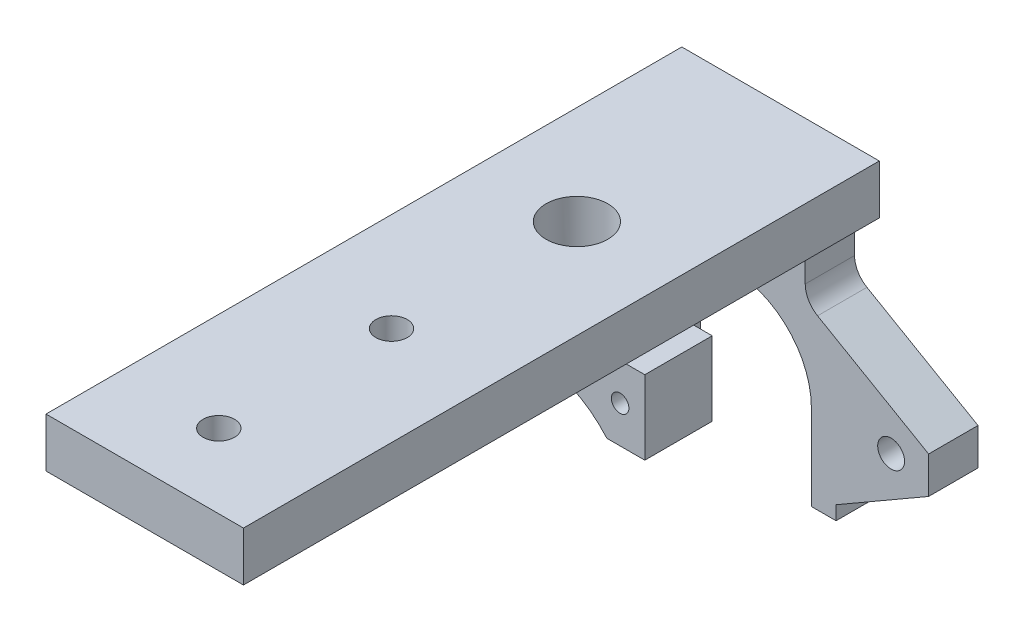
from build123d import *

# Parameters (mm, degrees)
EXTRUDE1_DEPTH            = 25.4
CUT_EXTRUDE1_REACH        = 95.1
SKETCH6_W                 = 12.7
SKETCH6_H                 = 75.438
CUT_EXTRUDE2_DEPTH        = 91.797650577
EXTRUDE2_DEPTH            = 2.38125
EXTRUDE2_DEPTH_BACK       = 27.78125
SKETCH7_W                 = 8.6741
SKETCH7_H                 = 9.525
CUT_EXTRUDE4_REACH        = 68.358
SKETCH11_R                = 13.49375
F_4_40_TAPPED_HOLE1_D     = 2.2606
F_4_40_TAPPED_HOLE1_DEPTH = 8.6741
F_8_32_TAPPED_HOLE4_D     = 3.4544
F_8_32_TAPPED_HOLE4_DEPTH = 6.77545
CUT_EXTRUDE3_REACH        = 90.093
SKETCH8_R                 = 3.96875
F_10_32_TAPPED_HOLE1_D    = 4.0386
CUT_EXTRUDE5_REACH        = 95.1


with BuildPart() as part:
    # Sketch1 → Extrude1 (new, symmetric)
    with BuildSketch(Plane(origin=(0, 0, 0), x_dir=(0, 0, -1), z_dir=(1, 0, 0))):
        Polygon((0, 0), (-81.788, 0), (-81.788, -6.35), (-6.35, -6.35), (-6.35, -36.5125), (0, -36.5125), align=None)
    extrude(amount=EXTRUDE1_DEPTH, both=True)

    # Sketch2 → Cut-Extrude1 (cut, up to next)
    with BuildSketch(Plane(origin=(0, 0, 0), x_dir=(-1, 0, 0), z_dir=(0, 0, -1)), mode=Mode.PRIVATE) as cut_extrude1_sk1:
        with BuildLine():
            Line((-10.31875, -25.5016), (-10.31875, -41.376576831))
            Line((-10.31875, -41.376576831), (10.31875, -41.376576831))
            Line((10.31875, -41.376576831), (10.31875, -25.5016))
            ThreePointArc((10.31875, -25.5016), (0, -15.18285), (-10.31875, -25.5016))
        make_face()
    cut_extrude1_tool1 = extrude(cut_extrude1_sk1.sketch, amount=-CUT_EXTRUDE1_REACH, mode=Mode.PRIVATE) & part.part
    add(cut_extrude1_tool1.solids().sort_by_distance((0, -29.276324, 0))[0], mode=Mode.SUBTRACT)

    # Sketch6 → Cut-Extrude2 (cut, through all)
    with BuildSketch(Plane.XZ.offset(6.35)):
        with Locations((19.05, 44.069)):
            Rectangle(SKETCH6_W, SKETCH6_H)
        with Locations((-19.05, 44.069)):
            Rectangle(SKETCH6_W, SKETCH6_H)
    extrude(amount=-CUT_EXTRUDE2_DEPTH, mode=Mode.SUBTRACT)

    # Sketch7 → Extrude2 (add, two sides: drawn at the far end of the back side and taken through both)
    with BuildSketch(Plane(origin=(12.7, 0, 0), x_dir=(0, 0, -1), z_dir=(1, 0, 0)).offset(-EXTRUDE2_DEPTH_BACK)):
        with Locations((-28.2067, -11.1125)):
            Rectangle(SKETCH7_W, SKETCH7_H)
    extrude(amount=EXTRUDE2_DEPTH + EXTRUDE2_DEPTH_BACK)

    # Sketch11 → Cut-Extrude4 (cut, up to next)
    with BuildSketch(Plane.XY.offset(32.54375), mode=Mode.PRIVATE) as cut_extrude4_sk1:
        with Locations((0, -24.70785)):
            Circle(SKETCH11_R)
    cut_extrude4_tool1 = extrude(cut_extrude4_sk1.sketch, amount=-CUT_EXTRUDE4_REACH, mode=Mode.PRIVATE) & part.part
    add(cut_extrude4_tool1.solids().sort_by_distance((0, -24.70785, 32.54375))[0], mode=Mode.SUBTRACT)

    # 4-40 Tapped Hole1
    with Locations(Plane.XY.offset(32.54375)):
        with Locations((-11.90625, -11.1125), (11.90625, -11.1125)):
            Hole(F_4_40_TAPPED_HOLE1_D / 2, depth=F_4_40_TAPPED_HOLE1_DEPTH)

    # 8-32 Tapped Hole4
    with Locations(Plane(origin=(20.57399608, -25.4889, 0), x_dir=(0, -1, 0), z_dir=(0, 0, -1))):
        with Locations((0, 0), (0, 41.148)):
            Hole(F_8_32_TAPPED_HOLE4_D / 2, depth=F_8_32_TAPPED_HOLE4_DEPTH)

    # Sketch8 → Cut-Extrude3 (cut, up to next)
    with BuildSketch(Plane.XZ.offset(15.875), mode=Mode.PRIVATE) as cut_extrude3_sk1:
        with Locations(Location((0, 26.19375, 0), (0, 0, 324.154611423))):
            Circle(SKETCH8_R)
    cut_extrude3_tool1 = extrude(cut_extrude3_sk1.sketch, amount=-CUT_EXTRUDE3_REACH, mode=Mode.PRIVATE) & part.part
    add(cut_extrude3_tool1.solids().sort_by_distance((0, -15.875, 26.19375))[0], mode=Mode.SUBTRACT)

    # 10-32 Tapped Hole1 (through all)
    with Locations(Plane(origin=(0, 0, 0), x_dir=(-1, 0, 0), z_dir=(0, 1, 0))):
        with Locations((0, 72.263), (0, 50.038)):
            Hole(F_10_32_TAPPED_HOLE1_D / 2)

    # Sketch12 → Cut-Extrude5 (cut, up to next)
    with BuildSketch(Plane.XY, mode=Mode.PRIVATE) as cut_extrude5_sk1:
        with BuildLine():
            Line((12.7, 0), (12.7, -6.35))
            ThreePointArc((12.7, -6.35), (10.45493597, -7.27993597), (9.525, -9.525))
            Line((9.525, -9.525), (9.525, -12.118934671))
            ThreePointArc((9.525, -12.118934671), (9.950369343, -13.706434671), (11.1125, -14.868565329))
            Line((11.1125, -14.868565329), (25.4, -23.1174573))
            Line((25.4, -23.1174573), (25.4, 0))
            Line((25.4, 0), (12.7, 0))
        make_face()
    cut_extrude5_tool1 = extrude(cut_extrude5_sk1.sketch, amount=CUT_EXTRUDE5_REACH, mode=Mode.PRIVATE) & part.part
    # Sketch12 → Cut-Extrude5 (cut, up to next)
    with BuildSketch(Plane.XY, mode=Mode.PRIVATE) as cut_extrude5_sk2:
        Polygon((25.4, -27.8511), (13.49375, -34.725176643), (13.49375, -36.5125), (25.4, -36.5125), align=None)
    cut_extrude5_tool2 = extrude(cut_extrude5_sk2.sketch, amount=CUT_EXTRUDE5_REACH, mode=Mode.PRIVATE) & part.part
    # Sketch12 → Cut-Extrude5 (cut, up to next)
    with BuildSketch(Plane.XY, mode=Mode.PRIVATE) as cut_extrude5_sk3:
        Polygon((-13.49375, -34.725176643), (-13.49375, -36.5125), (-25.4, -36.5125), (-25.4, -27.8511), align=None)
    cut_extrude5_tool3 = extrude(cut_extrude5_sk3.sketch, amount=CUT_EXTRUDE5_REACH, mode=Mode.PRIVATE) & part.part
    # Sketch12 → Cut-Extrude5 (cut, up to next)
    with BuildSketch(Plane.XY, mode=Mode.PRIVATE) as cut_extrude5_sk4:
        with BuildLine():
            Line((-25.4, -23.1174573), (-11.1125, -14.868565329))
            ThreePointArc((-11.1125, -14.868565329), (-9.950369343, -13.706434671), (-9.525, -12.118934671))
            Line((-9.525, -12.118934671), (-9.525, -9.525))
            ThreePointArc((-9.525, -9.525), (-10.45493597, -7.27993597), (-12.7, -6.35))
            Line((-12.7, -6.35), (-12.7, 0))
            Line((-12.7, 0), (-25.4, 0))
            Line((-25.4, 0), (-25.4, -23.1174573))
        make_face()
    cut_extrude5_tool4 = extrude(cut_extrude5_sk4.sketch, amount=CUT_EXTRUDE5_REACH, mode=Mode.PRIVATE) & part.part
    add(cut_extrude5_tool1.solids().sort_by_distance((18.716376, -9.933386, 0))[0], mode=Mode.SUBTRACT)
    add(cut_extrude5_tool2.solids().sort_by_distance((20.752369, -33.523455, 0))[0], mode=Mode.SUBTRACT)
    add(cut_extrude5_tool3.solids().sort_by_distance((-20.752369, -33.523455, 0))[0], mode=Mode.SUBTRACT)
    add(cut_extrude5_tool4.solids().sort_by_distance((-18.716376, -9.933386, 0))[0], mode=Mode.SUBTRACT)


solid = part.part
